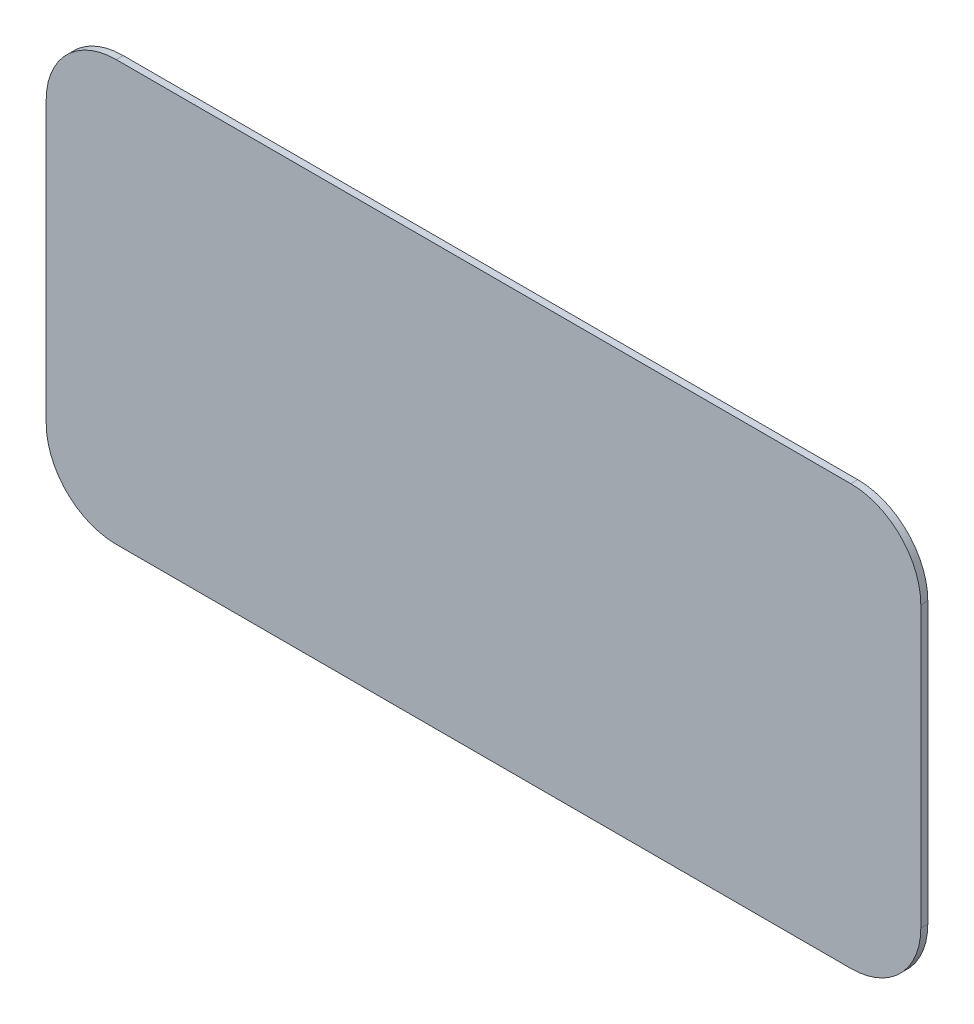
from build123d import *

# Parameters (mm, degrees)
BOSS_EXTRU_1_DEPTH = 0.2


with BuildPart() as part:
    # Esquisse1 → Boss.-Extru.1 (new body)
    with BuildSketch(Plane.XY):
        with BuildLine():
            Line((-21.848822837, 2.338176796), (-0.848822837, 2.338176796))
            ThreePointArc((-0.848822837, 2.338176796), (0.565390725, 1.752390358), (1.151177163, 0.338176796))
            Line((1.151177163, 0.338176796), (1.151177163, -7.661823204))
            ThreePointArc((1.151177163, -7.661823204), (0.565390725, -9.076036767), (-0.848822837, -9.661823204))
            Line((-0.848822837, -9.661823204), (-21.848822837, -9.661823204))
            ThreePointArc((-21.848822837, -9.661823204), (-23.263036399, -9.076036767), (-23.848822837, -7.661823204))
            Line((-23.848822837, -7.661823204), (-23.848822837, 0.338176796))
            ThreePointArc((-23.848822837, 0.338176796), (-23.263036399, 1.752390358), (-21.848822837, 2.338176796))
        make_face()
    extrude(amount=BOSS_EXTRU_1_DEPTH)


solid = part.part
